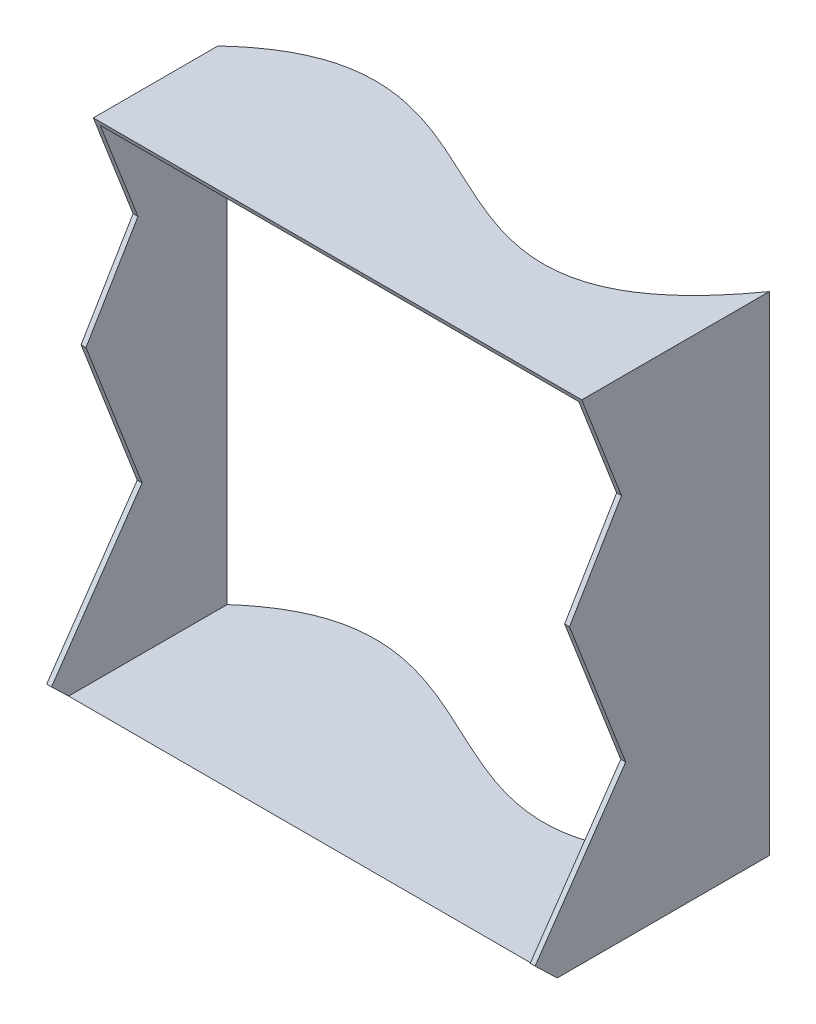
ISO-10303-21;
HEADER;
FILE_DESCRIPTION(('STEP AP214'),'2;1');
FILE_NAME('part.step','',(''),(''),'','','');
FILE_SCHEMA(('AUTOMOTIVE_DESIGN { 1 0 10303 214 1 1 1 1 }'));
ENDSEC;
DATA;
#1=APPLICATION_CONTEXT('core data for automotive mechanical design processes');
#2=APPLICATION_PROTOCOL_DEFINITION('international standard','automotive_design',2000,#1);
#3=PRODUCT_CONTEXT('',#1,'mechanical');
#4=PRODUCT('Part','Part','',(#3));
#5=PRODUCT_RELATED_PRODUCT_CATEGORY('part','',(#4));
#6=PRODUCT_DEFINITION_FORMATION('','',#4);
#7=PRODUCT_DEFINITION_CONTEXT('part definition',#1,'design');
#8=PRODUCT_DEFINITION('design','',#6,#7);
#9=PRODUCT_DEFINITION_SHAPE('','',#8);
#10=(LENGTH_UNIT() NAMED_UNIT(*) SI_UNIT(.MILLI.,.METRE.));
#11=(NAMED_UNIT(*) PLANE_ANGLE_UNIT() SI_UNIT($,.RADIAN.));
#12=(NAMED_UNIT(*) SI_UNIT($,.STERADIAN.) SOLID_ANGLE_UNIT());
#13=UNCERTAINTY_MEASURE_WITH_UNIT(LENGTH_MEASURE(1.E-05),#10,'distance_accuracy_value','');
#14=(GEOMETRIC_REPRESENTATION_CONTEXT(3) GLOBAL_UNCERTAINTY_ASSIGNED_CONTEXT((#13)) GLOBAL_UNIT_ASSIGNED_CONTEXT((#10,
#11,#12)) REPRESENTATION_CONTEXT('',''));
#15=CARTESIAN_POINT('',(0.,0.,0.));
#16=DIRECTION('',(0.,0.,1.));
#17=DIRECTION('',(1.,0.,0.));
#18=AXIS2_PLACEMENT_3D('',#15,#16,#17);
#19=CARTESIAN_POINT('',(50.,-50.,100.));
#20=DIRECTION('',(-1.,0.,0.));
#21=DIRECTION('',(0.,0.,1.));
#22=AXIS2_PLACEMENT_3D('',#19,#20,#21);
#23=PLANE('',#22);
#24=DIRECTION('',(0.,-0.694356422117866,-0.719631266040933));
#25=VECTOR('',#24,1.);
#26=CARTESIAN_POINT('',(50.,-45.624283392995,76.1095818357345));
#27=LINE('',#26,#25);
#28=CARTESIAN_POINT('',(50.,-45.624283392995,76.1095818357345));
#29=VERTEX_POINT('',#28);
#30=CARTESIAN_POINT('',(50.,-50.,71.5745874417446));
#31=VERTEX_POINT('',#30);
#32=EDGE_CURVE('E161',#29,#31,#27,.T.);
#33=ORIENTED_EDGE('',*,*,#32,.T.);
#34=DIRECTION('',(0.,0.,-1.));
#35=VECTOR('',#34,1.);
#36=CARTESIAN_POINT('',(50.,-50.,100.));
#37=LINE('',#36,#35);
#38=CARTESIAN_POINT('',(50.,-50.,28.1553530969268));
#39=VERTEX_POINT('',#38);
#40=EDGE_CURVE('E168',#31,#39,#37,.T.);
#41=ORIENTED_EDGE('',*,*,#40,.T.);
#42=DIRECTION('',(0.,1.,0.));
#43=VECTOR('',#42,1.);
#44=CARTESIAN_POINT('',(50.,-50.,28.1553530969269));
#45=LINE('',#44,#43);
#46=CARTESIAN_POINT('',(50.,50.,28.1553530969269));
#47=VERTEX_POINT('',#46);
#48=EDGE_CURVE('E202',#39,#47,#45,.T.);
#49=ORIENTED_EDGE('',*,*,#48,.T.);
#50=DIRECTION('',(0.,0.,-1.));
#51=VECTOR('',#50,1.);
#52=CARTESIAN_POINT('',(50.,50.,100.));
#53=LINE('',#52,#51);
#54=CARTESIAN_POINT('',(50.,50.,66.5591492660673));
#55=VERTEX_POINT('',#54);
#56=EDGE_CURVE('E11',#55,#47,#53,.T.);
#57=ORIENTED_EDGE('',*,*,#56,.F.);
#58=DIRECTION('',(0.,-0.932741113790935,-0.360546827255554));
#59=VECTOR('',#58,1.);
#60=CARTESIAN_POINT('',(50.,50.,66.5591492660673));
#61=LINE('',#60,#59);
#62=CARTESIAN_POINT('',(50.,28.9465108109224,58.421018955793));
#63=VERTEX_POINT('',#62);
#64=EDGE_CURVE('E148',#55,#63,#61,.T.);
#65=ORIENTED_EDGE('',*,*,#64,.T.);
#66=DIRECTION('',(0.,-0.859884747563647,0.510488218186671));
#67=VECTOR('',#66,1.);
#68=CARTESIAN_POINT('',(50.,28.9465108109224,58.421018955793));
#69=LINE('',#68,#67);
#70=CARTESIAN_POINT('',(50.,11.0146765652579,69.0666201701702));
#71=VERTEX_POINT('',#70);
#72=EDGE_CURVE('E282',#63,#71,#69,.T.);
#73=ORIENTED_EDGE('',*,*,#72,.T.);
#74=DIRECTION('',(0.,-0.932741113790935,-0.360546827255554));
#75=VECTOR('',#74,1.);
#76=CARTESIAN_POINT('',(50.,11.0146765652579,69.0666201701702));
#77=LINE('',#76,#75);
#78=CARTESIAN_POINT('',(50.,-18.7217324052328,57.5721467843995));
#79=VERTEX_POINT('',#78);
#80=EDGE_CURVE('E285',#71,#79,#77,.T.);
#81=ORIENTED_EDGE('',*,*,#80,.T.);
#82=DIRECTION('',(0.,-0.823442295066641,0.567400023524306));
#83=VECTOR('',#82,1.);
#84=CARTESIAN_POINT('',(50.,-18.7217324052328,57.5721467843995));
#85=LINE('',#84,#83);
#86=EDGE_CURVE('E267',#79,#29,#85,.T.);
#87=ORIENTED_EDGE('',*,*,#86,.T.);
#88=EDGE_LOOP('',(#33,#41,#49,#57,#65,#73,#81,#87));
#89=FACE_BOUND('',#88,.T.);
#90=ADVANCED_FACE('F31',(#89),#23,.F.);
#91=CARTESIAN_POINT('',(-50.,50.,100.));
#92=DIRECTION('',(0.,-1.,0.));
#93=DIRECTION('',(0.,0.,-1.));
#94=AXIS2_PLACEMENT_3D('',#91,#92,#93);
#95=PLANE('',#94);
#96=DIRECTION('',(1.,0.,0.));
#97=VECTOR('',#96,1.);
#98=CARTESIAN_POINT('',(-50.,50.,66.5591492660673));
#99=LINE('',#98,#97);
#100=CARTESIAN_POINT('',(-50.,50.,66.5591492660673));
#101=VERTEX_POINT('',#100);
#102=EDGE_CURVE('E141',#101,#55,#99,.T.);
#103=ORIENTED_EDGE('',*,*,#102,.T.);
#104=ORIENTED_EDGE('',*,*,#56,.T.);
#105=CARTESIAN_POINT('',(50.,50.,28.1553530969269));
#106=CARTESIAN_POINT('',(14.5301264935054,50.,77.941452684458));
#107=CARTESIAN_POINT('',(-13.036398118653,50.,6.22595688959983));
#108=CARTESIAN_POINT('',(-50.,50.,41.0775385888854));
#109=B_SPLINE_CURVE_WITH_KNOTS('',3,(#105,#106,#107,#108),.UNSPECIFIED.,.F.,.F.,(4,4),(0.,1.),.UNSPECIFIED.);
#110=CARTESIAN_POINT('',(-50.,50.,41.0775385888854));
#111=VERTEX_POINT('',#110);
#112=EDGE_CURVE('E166',#47,#111,#109,.T.);
#113=ORIENTED_EDGE('',*,*,#112,.T.);
#114=DIRECTION('',(0.,0.,-1.));
#115=VECTOR('',#114,1.);
#116=CARTESIAN_POINT('',(-50.,50.,100.));
#117=LINE('',#116,#115);
#118=EDGE_CURVE('E38',#101,#111,#117,.T.);
#119=ORIENTED_EDGE('',*,*,#118,.F.);
#120=EDGE_LOOP('',(#103,#104,#113,#119));
#121=FACE_BOUND('',#120,.T.);
#122=ADVANCED_FACE('F164',(#121),#95,.F.);
#123=CARTESIAN_POINT('',(-50.,-50.,100.));
#124=DIRECTION('',(1.,0.,0.));
#125=DIRECTION('',(0.,0.,-1.));
#126=AXIS2_PLACEMENT_3D('',#123,#124,#125);
#127=PLANE('',#126);
#128=DIRECTION('',(0.,-0.694356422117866,-0.719631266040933));
#129=VECTOR('',#128,1.);
#130=CARTESIAN_POINT('',(-50.,-45.624283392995,76.1095818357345));
#131=LINE('',#130,#129);
#132=CARTESIAN_POINT('',(-50.,-45.624283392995,76.1095818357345));
#133=VERTEX_POINT('',#132);
#134=CARTESIAN_POINT('',(-50.,-50.,71.5745874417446));
#135=VERTEX_POINT('',#134);
#136=EDGE_CURVE('E45',#133,#135,#131,.T.);
#137=ORIENTED_EDGE('',*,*,#136,.F.);
#138=DIRECTION('',(0.,-0.823442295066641,0.567400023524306));
#139=VECTOR('',#138,1.);
#140=CARTESIAN_POINT('',(-50.,-18.7217324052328,57.5721467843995));
#141=LINE('',#140,#139);
#142=CARTESIAN_POINT('',(-50.,-18.7217324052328,57.5721467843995));
#143=VERTEX_POINT('',#142);
#144=EDGE_CURVE('E275',#143,#133,#141,.T.);
#145=ORIENTED_EDGE('',*,*,#144,.F.);
#146=DIRECTION('',(0.,-0.932741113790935,-0.360546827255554));
#147=VECTOR('',#146,1.);
#148=CARTESIAN_POINT('',(-50.,11.0146765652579,69.0666201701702));
#149=LINE('',#148,#147);
#150=CARTESIAN_POINT('',(-50.,11.0146765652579,69.0666201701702));
#151=VERTEX_POINT('',#150);
#152=EDGE_CURVE('E277',#151,#143,#149,.T.);
#153=ORIENTED_EDGE('',*,*,#152,.F.);
#154=DIRECTION('',(0.,-0.859884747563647,0.510488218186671));
#155=VECTOR('',#154,1.);
#156=CARTESIAN_POINT('',(-50.,28.9465108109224,58.421018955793));
#157=LINE('',#156,#155);
#158=CARTESIAN_POINT('',(-50.,28.9465108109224,58.421018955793));
#159=VERTEX_POINT('',#158);
#160=EDGE_CURVE('E160',#159,#151,#157,.T.);
#161=ORIENTED_EDGE('',*,*,#160,.F.);
#162=DIRECTION('',(0.,-0.932741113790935,-0.360546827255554));
#163=VECTOR('',#162,1.);
#164=CARTESIAN_POINT('',(-50.,50.,66.5591492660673));
#165=LINE('',#164,#163);
#166=EDGE_CURVE('E145',#101,#159,#165,.T.);
#167=ORIENTED_EDGE('',*,*,#166,.F.);
#168=ORIENTED_EDGE('',*,*,#118,.T.);
#169=DIRECTION('',(0.,1.,0.));
#170=VECTOR('',#169,1.);
#171=CARTESIAN_POINT('',(-50.,-50.,41.0775385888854));
#172=LINE('',#171,#170);
#173=CARTESIAN_POINT('',(-50.,-50.,41.0775385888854));
#174=VERTEX_POINT('',#173);
#175=EDGE_CURVE('E203',#174,#111,#172,.T.);
#176=ORIENTED_EDGE('',*,*,#175,.F.);
#177=DIRECTION('',(0.,0.,-1.));
#178=VECTOR('',#177,1.);
#179=CARTESIAN_POINT('',(-50.,-50.,100.));
#180=LINE('',#179,#178);
#181=EDGE_CURVE('E167',#135,#174,#180,.T.);
#182=ORIENTED_EDGE('',*,*,#181,.F.);
#183=EDGE_LOOP('',(#137,#145,#153,#161,#167,#168,#176,#182));
#184=FACE_BOUND('',#183,.T.);
#185=ADVANCED_FACE('F155',(#184),#127,.F.);
#186=CARTESIAN_POINT('',(-50.,-50.,100.));
#187=DIRECTION('',(0.,1.,0.));
#188=DIRECTION('',(0.,0.,1.));
#189=AXIS2_PLACEMENT_3D('',#186,#187,#188);
#190=PLANE('',#189);
#191=DIRECTION('',(1.,0.,0.));
#192=VECTOR('',#191,1.);
#193=CARTESIAN_POINT('',(-50.,-50.,71.5745874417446));
#194=LINE('',#193,#192);
#195=EDGE_CURVE('E270',#135,#31,#194,.T.);
#196=ORIENTED_EDGE('',*,*,#195,.F.);
#197=ORIENTED_EDGE('',*,*,#181,.T.);
#198=CARTESIAN_POINT('',(50.,-50.,28.1553530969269));
#199=CARTESIAN_POINT('',(14.5301264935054,-50.,77.941452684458));
#200=CARTESIAN_POINT('',(-13.036398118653,-50.,6.22595688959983));
#201=CARTESIAN_POINT('',(-50.,-50.,41.0775385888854));
#202=B_SPLINE_CURVE_WITH_KNOTS('',3,(#198,#199,#200,#201),.UNSPECIFIED.,.F.,.F.,(4,4),(0.,1.),.UNSPECIFIED.);
#203=EDGE_CURVE('E205',#39,#174,#202,.T.);
#204=ORIENTED_EDGE('',*,*,#203,.F.);
#205=ORIENTED_EDGE('',*,*,#40,.F.);
#206=EDGE_LOOP('',(#196,#197,#204,#205));
#207=FACE_BOUND('',#206,.T.);
#208=ADVANCED_FACE('F237',(#207),#190,.F.);
#209=CARTESIAN_POINT('',(49.,-50.,100.));
#210=DIRECTION('',(-1.,0.,0.));
#211=DIRECTION('',(0.,0.,1.));
#212=AXIS2_PLACEMENT_3D('',#209,#210,#211);
#213=PLANE('',#212);
#214=DIRECTION('',(0.,0.,-1.));
#215=VECTOR('',#214,1.);
#216=CARTESIAN_POINT('',(49.,-49.,100.));
#217=LINE('',#216,#215);
#218=CARTESIAN_POINT('',(49.,-49.,72.6109878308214));
#219=VERTEX_POINT('',#218);
#220=CARTESIAN_POINT('',(49.,-49.,29.5297650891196));
#221=VERTEX_POINT('',#220);
#222=EDGE_CURVE('E176',#219,#221,#217,.T.);
#223=ORIENTED_EDGE('',*,*,#222,.F.);
#224=DIRECTION('',(0.,0.694356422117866,0.719631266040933));
#225=VECTOR('',#224,1.);
#226=CARTESIAN_POINT('',(49.,-35.7963730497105,86.2952319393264));
#227=LINE('',#226,#225);
#228=CARTESIAN_POINT('',(49.,-45.624283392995,76.1095818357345));
#229=VERTEX_POINT('',#228);
#230=EDGE_CURVE('E52',#219,#229,#227,.T.);
#231=ORIENTED_EDGE('',*,*,#230,.T.);
#232=DIRECTION('',(0.,0.823442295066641,-0.567400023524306));
#233=VECTOR('',#232,1.);
#234=CARTESIAN_POINT('',(49.,-59.7533789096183,85.8453571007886));
#235=LINE('',#234,#233);
#236=CARTESIAN_POINT('',(49.,-18.7217324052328,57.5721467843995));
#237=VERTEX_POINT('',#236);
#238=EDGE_CURVE('E316',#229,#237,#235,.T.);
#239=ORIENTED_EDGE('',*,*,#238,.T.);
#240=DIRECTION('',(0.,0.932741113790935,0.360546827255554));
#241=VECTOR('',#240,1.);
#242=CARTESIAN_POINT('',(49.,-31.6656590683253,52.5687309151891));
#243=LINE('',#242,#241);
#244=CARTESIAN_POINT('',(49.,11.0146765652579,69.0666201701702));
#245=VERTEX_POINT('',#244);
#246=EDGE_CURVE('E313',#237,#245,#243,.T.);
#247=ORIENTED_EDGE('',*,*,#246,.T.);
#248=DIRECTION('',(0.,0.859884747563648,-0.510488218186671));
#249=VECTOR('',#248,1.);
#250=CARTESIAN_POINT('',(49.,-47.6782321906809,103.910869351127));
#251=LINE('',#250,#249);
#252=CARTESIAN_POINT('',(49.,28.9465108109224,58.421018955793));
#253=VERTEX_POINT('',#252);
#254=EDGE_CURVE('E310',#245,#253,#251,.T.);
#255=ORIENTED_EDGE('',*,*,#254,.T.);
#256=DIRECTION('',(0.,0.932741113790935,0.360546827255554));
#257=VECTOR('',#256,1.);
#258=CARTESIAN_POINT('',(49.,-25.7545457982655,37.2765747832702));
#259=LINE('',#258,#257);
#260=CARTESIAN_POINT('',(49.,49.,66.1726038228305));
#261=VERTEX_POINT('',#260);
#262=EDGE_CURVE('E307',#253,#261,#259,.T.);
#263=ORIENTED_EDGE('',*,*,#262,.T.);
#264=DIRECTION('',(0.,0.,-1.));
#265=VECTOR('',#264,1.);
#266=CARTESIAN_POINT('',(49.,49.,100.));
#267=LINE('',#266,#265);
#268=CARTESIAN_POINT('',(49.000000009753,49.,29.5297650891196));
#269=VERTEX_POINT('',#268);
#270=EDGE_CURVE('E172',#261,#269,#267,.T.);
#271=ORIENTED_EDGE('',*,*,#270,.T.);
#272=DIRECTION('',(0.,1.,0.));
#273=VECTOR('',#272,1.);
#274=CARTESIAN_POINT('',(49.,-50.,29.5297651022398));
#275=LINE('',#274,#273);
#276=EDGE_CURVE('E185',#269,#221,#275,.F.);
#277=ORIENTED_EDGE('',*,*,#276,.T.);
#278=EDGE_LOOP('',(#223,#231,#239,#247,#255,#263,#271,#277));
#279=FACE_BOUND('',#278,.T.);
#280=ADVANCED_FACE('F233',(#279),#213,.T.);
#281=CARTESIAN_POINT('',(-50.,49.,100.));
#282=DIRECTION('',(0.,-1.,0.));
#283=DIRECTION('',(0.,0.,-1.));
#284=AXIS2_PLACEMENT_3D('',#281,#282,#283);
#285=PLANE('',#284);
#286=ORIENTED_EDGE('',*,*,#270,.F.);
#287=DIRECTION('',(-1.,0.,0.));
#288=VECTOR('',#287,1.);
#289=CARTESIAN_POINT('',(-50.,49.,66.1726038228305));
#290=LINE('',#289,#288);
#291=CARTESIAN_POINT('',(-49.,49.,66.1726038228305));
#292=VERTEX_POINT('',#291);
#293=EDGE_CURVE('E304',#261,#292,#290,.T.);
#294=ORIENTED_EDGE('',*,*,#293,.T.);
#295=DIRECTION('',(0.,0.,-1.));
#296=VECTOR('',#295,1.);
#297=CARTESIAN_POINT('',(-49.,49.,100.));
#298=LINE('',#297,#296);
#299=CARTESIAN_POINT('',(-49.,49.,40.1584665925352));
#300=VERTEX_POINT('',#299);
#301=EDGE_CURVE('E175',#292,#300,#298,.T.);
#302=ORIENTED_EDGE('',*,*,#301,.T.);
#303=CARTESIAN_POINT('',(50.,49.,28.1553530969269));
#304=CARTESIAN_POINT('',(14.5301264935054,49.,77.941452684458));
#305=CARTESIAN_POINT('',(-13.036398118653,49.,6.22595688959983));
#306=CARTESIAN_POINT('',(-50.,49.,41.0775385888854));
#307=B_SPLINE_CURVE_WITH_KNOTS('',3,(#303,#304,#305,#306),.UNSPECIFIED.,.F.,.F.,(4,4),(0.,1.),.UNSPECIFIED.);
#308=EDGE_CURVE('E191',#300,#269,#307,.F.);
#309=ORIENTED_EDGE('',*,*,#308,.T.);
#310=EDGE_LOOP('',(#286,#294,#302,#309));
#311=FACE_BOUND('',#310,.T.);
#312=ADVANCED_FACE('F236',(#311),#285,.T.);
#313=CARTESIAN_POINT('',(-49.,-50.,100.));
#314=DIRECTION('',(1.,0.,0.));
#315=DIRECTION('',(0.,0.,-1.));
#316=AXIS2_PLACEMENT_3D('',#313,#314,#315);
#317=PLANE('',#316);
#318=DIRECTION('',(0.,-0.823442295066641,0.567400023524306));
#319=VECTOR('',#318,1.);
#320=CARTESIAN_POINT('',(-49.,-59.7533789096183,85.8453571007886));
#321=LINE('',#320,#319);
#322=CARTESIAN_POINT('',(-49.,-18.7217324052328,57.5721467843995));
#323=VERTEX_POINT('',#322);
#324=CARTESIAN_POINT('',(-49.,-45.624283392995,76.1095818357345));
#325=VERTEX_POINT('',#324);
#326=EDGE_CURVE('E211',#323,#325,#321,.T.);
#327=ORIENTED_EDGE('',*,*,#326,.T.);
#328=DIRECTION('',(0.,-0.694356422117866,-0.719631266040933));
#329=VECTOR('',#328,1.);
#330=CARTESIAN_POINT('',(-49.,-35.7963730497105,86.2952319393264));
#331=LINE('',#330,#329);
#332=CARTESIAN_POINT('',(-49.,-49.,72.6109878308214));
#333=VERTEX_POINT('',#332);
#334=EDGE_CURVE('E289',#325,#333,#331,.T.);
#335=ORIENTED_EDGE('',*,*,#334,.T.);
#336=DIRECTION('',(0.,0.,-1.));
#337=VECTOR('',#336,1.);
#338=CARTESIAN_POINT('',(-49.,-49.,100.));
#339=LINE('',#338,#337);
#340=CARTESIAN_POINT('',(-49.,-49.,40.1584666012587));
#341=VERTEX_POINT('',#340);
#342=EDGE_CURVE('E173',#333,#341,#339,.T.);
#343=ORIENTED_EDGE('',*,*,#342,.T.);
#344=DIRECTION('',(0.,1.,0.));
#345=VECTOR('',#344,1.);
#346=CARTESIAN_POINT('',(-49.,-50.,40.1584665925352));
#347=LINE('',#346,#345);
#348=EDGE_CURVE('E196',#341,#300,#347,.T.);
#349=ORIENTED_EDGE('',*,*,#348,.T.);
#350=ORIENTED_EDGE('',*,*,#301,.F.);
#351=DIRECTION('',(0.,-0.932741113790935,-0.360546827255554));
#352=VECTOR('',#351,1.);
#353=CARTESIAN_POINT('',(-49.,-25.7545457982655,37.2765747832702));
#354=LINE('',#353,#352);
#355=CARTESIAN_POINT('',(-49.,28.9465108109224,58.421018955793));
#356=VERTEX_POINT('',#355);
#357=EDGE_CURVE('E321',#292,#356,#354,.T.);
#358=ORIENTED_EDGE('',*,*,#357,.T.);
#359=DIRECTION('',(0.,-0.859884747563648,0.510488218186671));
#360=VECTOR('',#359,1.);
#361=CARTESIAN_POINT('',(-49.,-47.6782321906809,103.910869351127));
#362=LINE('',#361,#360);
#363=CARTESIAN_POINT('',(-49.,11.0146765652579,69.0666201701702));
#364=VERTEX_POINT('',#363);
#365=EDGE_CURVE('E324',#356,#364,#362,.T.);
#366=ORIENTED_EDGE('',*,*,#365,.T.);
#367=DIRECTION('',(0.,-0.932741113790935,-0.360546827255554));
#368=VECTOR('',#367,1.);
#369=CARTESIAN_POINT('',(-49.,-31.6656590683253,52.5687309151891));
#370=LINE('',#369,#368);
#371=EDGE_CURVE('E326',#364,#323,#370,.T.);
#372=ORIENTED_EDGE('',*,*,#371,.T.);
#373=EDGE_LOOP('',(#327,#335,#343,#349,#350,#358,#366,#372));
#374=FACE_BOUND('',#373,.T.);
#375=ADVANCED_FACE('F241',(#374),#317,.T.);
#376=CARTESIAN_POINT('',(-50.,-49.,100.));
#377=DIRECTION('',(0.,1.,0.));
#378=DIRECTION('',(0.,0.,1.));
#379=AXIS2_PLACEMENT_3D('',#376,#377,#378);
#380=PLANE('',#379);
#381=ORIENTED_EDGE('',*,*,#342,.F.);
#382=DIRECTION('',(1.,0.,0.));
#383=VECTOR('',#382,1.);
#384=CARTESIAN_POINT('',(-50.,-49.,72.6109878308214));
#385=LINE('',#384,#383);
#386=EDGE_CURVE('E319',#333,#219,#385,.T.);
#387=ORIENTED_EDGE('',*,*,#386,.T.);
#388=ORIENTED_EDGE('',*,*,#222,.T.);
#389=CARTESIAN_POINT('',(50.,-49.,28.1553530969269));
#390=CARTESIAN_POINT('',(14.5301264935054,-49.,77.941452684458));
#391=CARTESIAN_POINT('',(-13.036398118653,-49.,6.22595688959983));
#392=CARTESIAN_POINT('',(-50.,-49.,41.0775385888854));
#393=B_SPLINE_CURVE_WITH_KNOTS('',3,(#389,#390,#391,#392),.UNSPECIFIED.,.F.,.F.,(4,4),(0.,1.),.UNSPECIFIED.);
#394=EDGE_CURVE('E179',#221,#341,#393,.T.);
#395=ORIENTED_EDGE('',*,*,#394,.T.);
#396=EDGE_LOOP('',(#381,#387,#388,#395));
#397=FACE_BOUND('',#396,.T.);
#398=ADVANCED_FACE('F230',(#397),#380,.T.);
#399=DIRECTION('',(0.,1.,0.));
#400=VECTOR('',#399,1.);
#401=SURFACE_OF_LINEAR_EXTRUSION('',#202,#400);
#402=ORIENTED_EDGE('',*,*,#276,.F.);
#403=ORIENTED_EDGE('',*,*,#308,.F.);
#404=ORIENTED_EDGE('',*,*,#348,.F.);
#405=ORIENTED_EDGE('',*,*,#394,.F.);
#406=EDGE_LOOP('',(#402,#403,#404,#405));
#407=FACE_BOUND('',#406,.T.);
#408=ORIENTED_EDGE('',*,*,#112,.F.);
#409=ORIENTED_EDGE('',*,*,#48,.F.);
#410=ORIENTED_EDGE('',*,*,#203,.T.);
#411=ORIENTED_EDGE('',*,*,#175,.T.);
#412=EDGE_LOOP('',(#408,#409,#410,#411));
#413=FACE_BOUND('',#412,.T.);
#414=ADVANCED_FACE('F225',(#407,#413),#401,.T.);
#415=CARTESIAN_POINT('',(-50.,-18.7217324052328,57.5721467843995));
#416=DIRECTION('',(0.,0.567400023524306,0.823442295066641));
#417=DIRECTION('',(0.,-0.823442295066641,0.567400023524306));
#418=AXIS2_PLACEMENT_3D('',#415,#416,#417);
#419=PLANE('',#418);
#420=ORIENTED_EDGE('',*,*,#238,.F.);
#421=DIRECTION('',(1.,0.,0.));
#422=VECTOR('',#421,1.);
#423=CARTESIAN_POINT('',(-50.,-45.624283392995,76.1095818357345));
#424=LINE('',#423,#422);
#425=EDGE_CURVE('E292',#229,#29,#424,.T.);
#426=ORIENTED_EDGE('',*,*,#425,.T.);
#427=ORIENTED_EDGE('',*,*,#86,.F.);
#428=DIRECTION('',(1.,0.,0.));
#429=VECTOR('',#428,1.);
#430=CARTESIAN_POINT('',(-50.,-18.7217324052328,57.5721467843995));
#431=LINE('',#430,#429);
#432=EDGE_CURVE('E295',#237,#79,#431,.T.);
#433=ORIENTED_EDGE('',*,*,#432,.F.);
#434=EDGE_LOOP('',(#420,#426,#427,#433));
#435=FACE_BOUND('',#434,.T.);
#436=ADVANCED_FACE('F229',(#435),#419,.T.);
#437=CARTESIAN_POINT('',(-50.,11.0146765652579,69.0666201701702));
#438=DIRECTION('',(0.,-0.360546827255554,0.932741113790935));
#439=DIRECTION('',(0.,-0.932741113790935,-0.360546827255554));
#440=AXIS2_PLACEMENT_3D('',#437,#438,#439);
#441=PLANE('',#440);
#442=ORIENTED_EDGE('',*,*,#246,.F.);
#443=ORIENTED_EDGE('',*,*,#432,.T.);
#444=ORIENTED_EDGE('',*,*,#80,.F.);
#445=DIRECTION('',(1.,0.,0.));
#446=VECTOR('',#445,1.);
#447=CARTESIAN_POINT('',(-50.,11.0146765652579,69.0666201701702));
#448=LINE('',#447,#446);
#449=EDGE_CURVE('E298',#245,#71,#448,.T.);
#450=ORIENTED_EDGE('',*,*,#449,.F.);
#451=EDGE_LOOP('',(#442,#443,#444,#450));
#452=FACE_BOUND('',#451,.T.);
#453=ADVANCED_FACE('F352',(#452),#441,.T.);
#454=CARTESIAN_POINT('',(-50.,28.9465108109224,58.421018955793));
#455=DIRECTION('',(0.,0.510488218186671,0.859884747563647));
#456=DIRECTION('',(0.,-0.859884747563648,0.510488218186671));
#457=AXIS2_PLACEMENT_3D('',#454,#455,#456);
#458=PLANE('',#457);
#459=ORIENTED_EDGE('',*,*,#254,.F.);
#460=ORIENTED_EDGE('',*,*,#449,.T.);
#461=ORIENTED_EDGE('',*,*,#72,.F.);
#462=DIRECTION('',(1.,0.,0.));
#463=VECTOR('',#462,1.);
#464=CARTESIAN_POINT('',(-50.,28.9465108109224,58.421018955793));
#465=LINE('',#464,#463);
#466=EDGE_CURVE('E152',#253,#63,#465,.T.);
#467=ORIENTED_EDGE('',*,*,#466,.F.);
#468=EDGE_LOOP('',(#459,#460,#461,#467));
#469=FACE_BOUND('',#468,.T.);
#470=ADVANCED_FACE('F357',(#469),#458,.T.);
#471=CARTESIAN_POINT('',(-50.,-45.624283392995,76.1095818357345));
#472=DIRECTION('',(0.,-0.719631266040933,0.694356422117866));
#473=DIRECTION('',(0.,-0.694356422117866,-0.719631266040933));
#474=AXIS2_PLACEMENT_3D('',#471,#472,#473);
#475=PLANE('',#474);
#476=ORIENTED_EDGE('',*,*,#230,.F.);
#477=ORIENTED_EDGE('',*,*,#386,.F.);
#478=ORIENTED_EDGE('',*,*,#334,.F.);
#479=EDGE_CURVE('E290',#133,#325,#424,.T.);
#480=ORIENTED_EDGE('',*,*,#479,.F.);
#481=ORIENTED_EDGE('',*,*,#136,.T.);
#482=ORIENTED_EDGE('',*,*,#195,.T.);
#483=ORIENTED_EDGE('',*,*,#32,.F.);
#484=ORIENTED_EDGE('',*,*,#425,.F.);
#485=EDGE_LOOP('',(#476,#477,#478,#480,#481,#482,#483,#484));
#486=FACE_BOUND('',#485,.T.);
#487=ADVANCED_FACE('F336',(#486),#475,.T.);
#488=ORIENTED_EDGE('',*,*,#326,.F.);
#489=EDGE_CURVE('E293',#143,#323,#431,.T.);
#490=ORIENTED_EDGE('',*,*,#489,.F.);
#491=ORIENTED_EDGE('',*,*,#144,.T.);
#492=ORIENTED_EDGE('',*,*,#479,.T.);
#493=EDGE_LOOP('',(#488,#490,#491,#492));
#494=FACE_BOUND('',#493,.T.);
#495=ADVANCED_FACE('F334',(#494),#419,.T.);
#496=ORIENTED_EDGE('',*,*,#371,.F.);
#497=EDGE_CURVE('E296',#151,#364,#448,.T.);
#498=ORIENTED_EDGE('',*,*,#497,.F.);
#499=ORIENTED_EDGE('',*,*,#152,.T.);
#500=ORIENTED_EDGE('',*,*,#489,.T.);
#501=EDGE_LOOP('',(#496,#498,#499,#500));
#502=FACE_BOUND('',#501,.T.);
#503=ADVANCED_FACE('F348',(#502),#441,.T.);
#504=ORIENTED_EDGE('',*,*,#365,.F.);
#505=EDGE_CURVE('E299',#159,#356,#465,.T.);
#506=ORIENTED_EDGE('',*,*,#505,.F.);
#507=ORIENTED_EDGE('',*,*,#160,.T.);
#508=ORIENTED_EDGE('',*,*,#497,.T.);
#509=EDGE_LOOP('',(#504,#506,#507,#508));
#510=FACE_BOUND('',#509,.T.);
#511=ADVANCED_FACE('F346',(#510),#458,.T.);
#512=CARTESIAN_POINT('',(-50.,50.,66.5591492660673));
#513=DIRECTION('',(0.,-0.360546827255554,0.932741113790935));
#514=DIRECTION('',(0.,-0.932741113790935,-0.360546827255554));
#515=AXIS2_PLACEMENT_3D('',#512,#513,#514);
#516=PLANE('',#515);
#517=ORIENTED_EDGE('',*,*,#262,.F.);
#518=ORIENTED_EDGE('',*,*,#466,.T.);
#519=ORIENTED_EDGE('',*,*,#64,.F.);
#520=ORIENTED_EDGE('',*,*,#102,.F.);
#521=ORIENTED_EDGE('',*,*,#166,.T.);
#522=ORIENTED_EDGE('',*,*,#505,.T.);
#523=ORIENTED_EDGE('',*,*,#357,.F.);
#524=ORIENTED_EDGE('',*,*,#293,.F.);
#525=EDGE_LOOP('',(#517,#518,#519,#520,#521,#522,#523,#524));
#526=FACE_BOUND('',#525,.T.);
#527=ADVANCED_FACE('F144',(#526),#516,.T.);
#528=CLOSED_SHELL('',(#90,#122,#185,#208,#280,#312,#375,#398,#414,#436,#453,#470,#487,#495,#503,
#511,#527));
#529=MANIFOLD_SOLID_BREP('B2',#528);
#530=ADVANCED_BREP_SHAPE_REPRESENTATION('',(#18,#529),#14);
#531=SHAPE_DEFINITION_REPRESENTATION(#9,#530);
ENDSEC;
END-ISO-10303-21;
